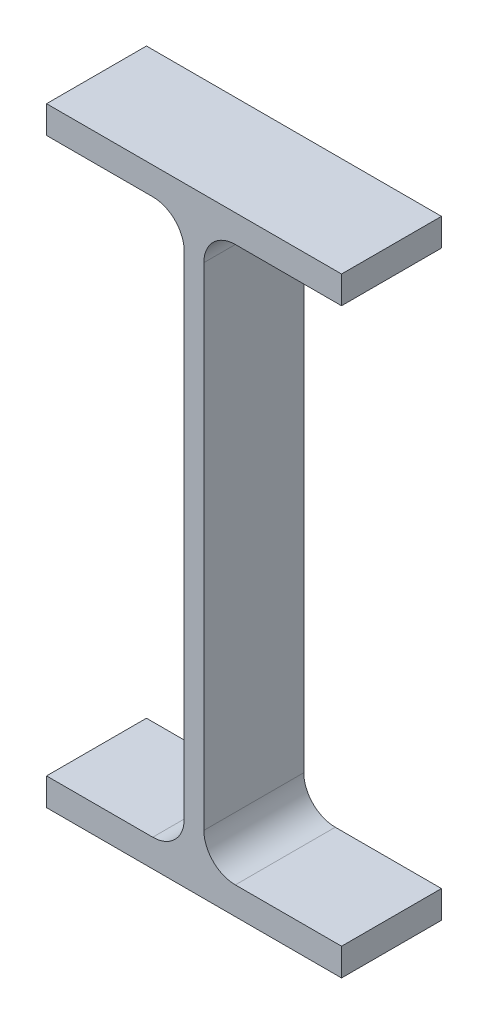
from build123d import *

# Parameters (mm, degrees)
BASESECTION_DEPTH = 12.7


with BuildPart() as part:
    # Sketch1 → BaseSection (new, symmetric)
    with BuildSketch(Plane.XY):
        with BuildLine():
            Line((-37.5, 77.5), (37.5, 77.5))
            Line((37.5, 77.5), (37.5, 70.5))
            Line((37.5, 70.5), (10.5, 70.5))
            ThreePointArc((10.5, 70.5), (4.843145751, 68.156854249), (2.5, 62.5))
            Line((2.5, 62.5), (2.5, -62.5))
            ThreePointArc((2.5, -62.5), (4.843145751, -68.156854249), (10.5, -70.5))
            Line((10.5, -70.5), (37.5, -70.5))
            Line((37.5, -70.5), (37.5, -77.5))
            Line((37.5, -77.5), (-37.5, -77.5))
            Line((-37.5, -77.5), (-37.5, -70.5))
            Line((-37.5, -70.5), (-10.5, -70.5))
            ThreePointArc((-10.5, -70.5), (-4.843145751, -68.156854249), (-2.5, -62.5))
            Line((-2.5, -62.5), (-2.5, 62.5))
            ThreePointArc((-2.5, 62.5), (-4.843145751, 68.156854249), (-10.5, 70.5))
            Line((-10.5, 70.5), (-37.5, 70.5))
            Line((-37.5, 70.5), (-37.5, 77.5))
        make_face()
    extrude(amount=BASESECTION_DEPTH, both=True)


solid = part.part
